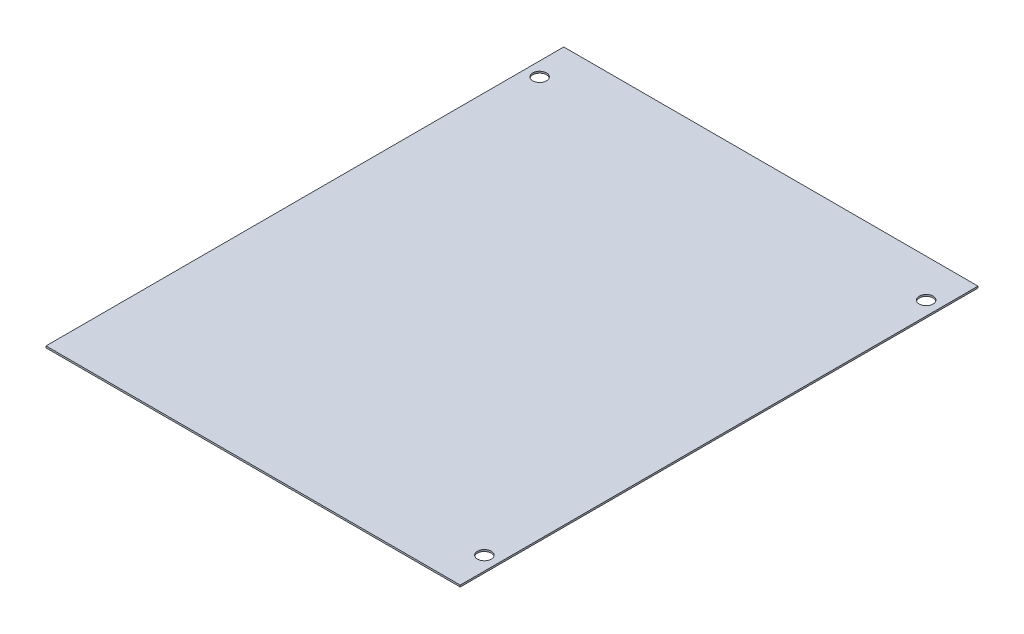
ISO-10303-21;
HEADER;
FILE_DESCRIPTION(('STEP AP214'),'2;1');
FILE_NAME('part.step','',(''),(''),'','','');
FILE_SCHEMA(('AUTOMOTIVE_DESIGN { 1 0 10303 214 1 1 1 1 }'));
ENDSEC;
DATA;
#1=APPLICATION_CONTEXT('core data for automotive mechanical design processes');
#2=APPLICATION_PROTOCOL_DEFINITION('international standard','automotive_design',2000,#1);
#3=PRODUCT_CONTEXT('',#1,'mechanical');
#4=PRODUCT('Part','Part','',(#3));
#5=PRODUCT_RELATED_PRODUCT_CATEGORY('part','',(#4));
#6=PRODUCT_DEFINITION_FORMATION('','',#4);
#7=PRODUCT_DEFINITION_CONTEXT('part definition',#1,'design');
#8=PRODUCT_DEFINITION('design','',#6,#7);
#9=PRODUCT_DEFINITION_SHAPE('','',#8);
#10=(LENGTH_UNIT() NAMED_UNIT(*) SI_UNIT(.MILLI.,.METRE.));
#11=(NAMED_UNIT(*) PLANE_ANGLE_UNIT() SI_UNIT($,.RADIAN.));
#12=(NAMED_UNIT(*) SI_UNIT($,.STERADIAN.) SOLID_ANGLE_UNIT());
#13=UNCERTAINTY_MEASURE_WITH_UNIT(LENGTH_MEASURE(1.E-05),#10,'distance_accuracy_value','');
#14=(GEOMETRIC_REPRESENTATION_CONTEXT(3) GLOBAL_UNCERTAINTY_ASSIGNED_CONTEXT((#13)) GLOBAL_UNIT_ASSIGNED_CONTEXT((#10,
#11,#12)) REPRESENTATION_CONTEXT('',''));
#15=CARTESIAN_POINT('',(0.,0.,0.));
#16=DIRECTION('',(0.,0.,1.));
#17=DIRECTION('',(1.,0.,0.));
#18=AXIS2_PLACEMENT_3D('',#15,#16,#17);
#19=CARTESIAN_POINT('',(-74.168738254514,6.35,-1849.30390133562));
#20=DIRECTION('',(1.,0.,0.));
#21=DIRECTION('',(0.,0.,-1.));
#22=AXIS2_PLACEMENT_3D('',#19,#20,#21);
#23=PLANE('',#22);
#24=DIRECTION('',(0.,0.,1.));
#25=VECTOR('',#24,1.);
#26=CARTESIAN_POINT('',(-74.168738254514,0.,-1849.30390133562));
#27=LINE('',#26,#25);
#28=CARTESIAN_POINT('',(-74.168738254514,0.,-1849.30390133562));
#29=VERTEX_POINT('',#28);
#30=CARTESIAN_POINT('',(-74.1687382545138,0.,55.6960986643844));
#31=VERTEX_POINT('',#30);
#32=EDGE_CURVE('E99',#29,#31,#27,.T.);
#33=ORIENTED_EDGE('',*,*,#32,.T.);
#34=DIRECTION('',(0.,-1.,0.));
#35=VECTOR('',#34,1.);
#36=CARTESIAN_POINT('',(-74.1687382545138,6.35,55.6960986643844));
#37=LINE('',#36,#35);
#38=CARTESIAN_POINT('',(-74.1687382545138,6.35,55.6960986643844));
#39=VERTEX_POINT('',#38);
#40=EDGE_CURVE('E11',#39,#31,#37,.T.);
#41=ORIENTED_EDGE('',*,*,#40,.F.);
#42=DIRECTION('',(0.,0.,1.));
#43=VECTOR('',#42,1.);
#44=CARTESIAN_POINT('',(-74.168738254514,6.35,-1849.30390133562));
#45=LINE('',#44,#43);
#46=CARTESIAN_POINT('',(-74.168738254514,6.35,-1849.30390133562));
#47=VERTEX_POINT('',#46);
#48=EDGE_CURVE('E86',#47,#39,#45,.T.);
#49=ORIENTED_EDGE('',*,*,#48,.F.);
#50=DIRECTION('',(0.,-1.,0.));
#51=VECTOR('',#50,1.);
#52=CARTESIAN_POINT('',(-74.168738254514,6.35,-1849.30390133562));
#53=LINE('',#52,#51);
#54=EDGE_CURVE('E95',#47,#29,#53,.T.);
#55=ORIENTED_EDGE('',*,*,#54,.T.);
#56=EDGE_LOOP('',(#33,#41,#49,#55));
#57=FACE_BOUND('',#56,.T.);
#58=ADVANCED_FACE('F33',(#57),#23,.F.);
#59=CARTESIAN_POINT('',(-74.1687382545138,6.35,55.6960986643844));
#60=DIRECTION('',(0.,0.,-1.));
#61=DIRECTION('',(-1.,0.,0.));
#62=AXIS2_PLACEMENT_3D('',#59,#60,#61);
#63=PLANE('',#62);
#64=DIRECTION('',(1.,0.,0.));
#65=VECTOR('',#64,1.);
#66=CARTESIAN_POINT('',(-74.1687382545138,0.,55.6960986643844));
#67=LINE('',#66,#65);
#68=CARTESIAN_POINT('',(1449.83126174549,0.,55.6960986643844));
#69=VERTEX_POINT('',#68);
#70=EDGE_CURVE('E90',#31,#69,#67,.T.);
#71=ORIENTED_EDGE('',*,*,#70,.T.);
#72=DIRECTION('',(0.,-1.,0.));
#73=VECTOR('',#72,1.);
#74=CARTESIAN_POINT('',(1449.83126174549,6.35,55.6960986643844));
#75=LINE('',#74,#73);
#76=CARTESIAN_POINT('',(1449.83126174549,6.35,55.6960986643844));
#77=VERTEX_POINT('',#76);
#78=EDGE_CURVE('E42',#77,#69,#75,.T.);
#79=ORIENTED_EDGE('',*,*,#78,.F.);
#80=DIRECTION('',(1.,0.,0.));
#81=VECTOR('',#80,1.);
#82=CARTESIAN_POINT('',(-74.1687382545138,6.35,55.6960986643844));
#83=LINE('',#82,#81);
#84=EDGE_CURVE('E81',#39,#77,#83,.T.);
#85=ORIENTED_EDGE('',*,*,#84,.F.);
#86=ORIENTED_EDGE('',*,*,#40,.T.);
#87=EDGE_LOOP('',(#71,#79,#85,#86));
#88=FACE_BOUND('',#87,.T.);
#89=ADVANCED_FACE('F89',(#88),#63,.F.);
#90=CARTESIAN_POINT('',(1449.83126174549,6.35,-1849.30390133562));
#91=DIRECTION('',(-1.,0.,0.));
#92=DIRECTION('',(0.,0.,1.));
#93=AXIS2_PLACEMENT_3D('',#90,#91,#92);
#94=PLANE('',#93);
#95=DIRECTION('',(0.,0.,-1.));
#96=VECTOR('',#95,1.);
#97=CARTESIAN_POINT('',(1449.83126174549,0.,-1849.30390133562));
#98=LINE('',#97,#96);
#99=CARTESIAN_POINT('',(1449.83126174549,0.,-1849.30390133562));
#100=VERTEX_POINT('',#99);
#101=EDGE_CURVE('E68',#69,#100,#98,.T.);
#102=ORIENTED_EDGE('',*,*,#101,.T.);
#103=DIRECTION('',(0.,-1.,0.));
#104=VECTOR('',#103,1.);
#105=CARTESIAN_POINT('',(1449.83126174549,6.35,-1849.30390133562));
#106=LINE('',#105,#104);
#107=CARTESIAN_POINT('',(1449.83126174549,6.35,-1849.30390133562));
#108=VERTEX_POINT('',#107);
#109=EDGE_CURVE('E91',#108,#100,#106,.T.);
#110=ORIENTED_EDGE('',*,*,#109,.F.);
#111=DIRECTION('',(0.,0.,-1.));
#112=VECTOR('',#111,1.);
#113=CARTESIAN_POINT('',(1449.83126174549,6.35,-1849.30390133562));
#114=LINE('',#113,#112);
#115=EDGE_CURVE('E84',#77,#108,#114,.T.);
#116=ORIENTED_EDGE('',*,*,#115,.F.);
#117=ORIENTED_EDGE('',*,*,#78,.T.);
#118=EDGE_LOOP('',(#102,#110,#116,#117));
#119=FACE_BOUND('',#118,.T.);
#120=ADVANCED_FACE('F93',(#119),#94,.F.);
#121=CARTESIAN_POINT('',(-74.168738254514,6.35,-1849.30390133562));
#122=DIRECTION('',(0.,0.,1.));
#123=DIRECTION('',(1.,0.,0.));
#124=AXIS2_PLACEMENT_3D('',#121,#122,#123);
#125=PLANE('',#124);
#126=DIRECTION('',(-1.,0.,0.));
#127=VECTOR('',#126,1.);
#128=CARTESIAN_POINT('',(-74.168738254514,0.,-1849.30390133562));
#129=LINE('',#128,#127);
#130=EDGE_CURVE('E74',#100,#29,#129,.T.);
#131=ORIENTED_EDGE('',*,*,#130,.T.);
#132=ORIENTED_EDGE('',*,*,#54,.F.);
#133=DIRECTION('',(-1.,0.,0.));
#134=VECTOR('',#133,1.);
#135=CARTESIAN_POINT('',(-74.168738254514,6.35,-1849.30390133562));
#136=LINE('',#135,#134);
#137=EDGE_CURVE('E51',#108,#47,#136,.T.);
#138=ORIENTED_EDGE('',*,*,#137,.F.);
#139=ORIENTED_EDGE('',*,*,#109,.T.);
#140=EDGE_LOOP('',(#131,#132,#138,#139));
#141=FACE_BOUND('',#140,.T.);
#142=ADVANCED_FACE('F133',(#141),#125,.F.);
#143=CARTESIAN_POINT('',(-74.1687382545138,6.35,55.6960986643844));
#144=DIRECTION('',(0.,1.,0.));
#145=DIRECTION('',(0.,0.,1.));
#146=AXIS2_PLACEMENT_3D('',#143,#144,#145);
#147=PLANE('',#146);
#148=CARTESIAN_POINT('',(1399.03126174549,6.35,-84.0039013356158));
#149=DIRECTION('',(0.,1.,0.));
#150=DIRECTION('',(0.,0.,1.));
#151=AXIS2_PLACEMENT_3D('',#148,#149,#150);
#152=CIRCLE('',#151,25.4);
#153=CARTESIAN_POINT('',(1399.03126174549,6.35,-58.6039013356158));
#154=VERTEX_POINT('',#153);
#155=EDGE_CURVE('E122',#154,#154,#152,.T.);
#156=ORIENTED_EDGE('',*,*,#155,.F.);
#157=EDGE_LOOP('',(#156));
#158=FACE_BOUND('',#157,.T.);
#159=CARTESIAN_POINT('',(1399.03126174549,6.35,-1709.60390133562));
#160=DIRECTION('',(0.,1.,0.));
#161=DIRECTION('',(0.,0.,1.));
#162=AXIS2_PLACEMENT_3D('',#159,#160,#161);
#163=CIRCLE('',#162,25.4);
#164=CARTESIAN_POINT('',(1399.03126174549,6.35,-1684.20390133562));
#165=VERTEX_POINT('',#164);
#166=EDGE_CURVE('E112',#165,#165,#163,.T.);
#167=ORIENTED_EDGE('',*,*,#166,.F.);
#168=EDGE_LOOP('',(#167));
#169=FACE_BOUND('',#168,.T.);
#170=CARTESIAN_POINT('',(-23.368738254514,6.35,-1709.60390133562));
#171=DIRECTION('',(0.,1.,0.));
#172=DIRECTION('',(0.,0.,1.));
#173=AXIS2_PLACEMENT_3D('',#170,#171,#172);
#174=CIRCLE('',#173,25.4);
#175=CARTESIAN_POINT('',(-23.368738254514,6.35,-1684.20390133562));
#176=VERTEX_POINT('',#175);
#177=EDGE_CURVE('E109',#176,#176,#174,.T.);
#178=ORIENTED_EDGE('',*,*,#177,.F.);
#179=EDGE_LOOP('',(#178));
#180=FACE_BOUND('',#179,.T.);
#181=ORIENTED_EDGE('',*,*,#48,.T.);
#182=ORIENTED_EDGE('',*,*,#84,.T.);
#183=ORIENTED_EDGE('',*,*,#115,.T.);
#184=ORIENTED_EDGE('',*,*,#137,.T.);
#185=EDGE_LOOP('',(#181,#182,#183,#184));
#186=FACE_BOUND('',#185,.T.);
#187=ADVANCED_FACE('F82',(#158,#169,#180,#186),#147,.T.);
#188=CARTESIAN_POINT('',(-74.1687382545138,0.,55.6960986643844));
#189=DIRECTION('',(0.,1.,0.));
#190=DIRECTION('',(0.,0.,1.));
#191=AXIS2_PLACEMENT_3D('',#188,#189,#190);
#192=PLANE('',#191);
#193=CARTESIAN_POINT('',(1399.03126174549,0.,-84.0039013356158));
#194=DIRECTION('',(0.,1.,0.));
#195=DIRECTION('',(0.,0.,1.));
#196=AXIS2_PLACEMENT_3D('',#193,#194,#195);
#197=CIRCLE('',#196,25.4);
#198=CARTESIAN_POINT('',(1399.03126174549,0.,-58.6039013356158));
#199=VERTEX_POINT('',#198);
#200=EDGE_CURVE('E36',#199,#199,#197,.T.);
#201=ORIENTED_EDGE('',*,*,#200,.T.);
#202=EDGE_LOOP('',(#201));
#203=FACE_BOUND('',#202,.T.);
#204=CARTESIAN_POINT('',(1399.03126174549,0.,-1709.60390133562));
#205=DIRECTION('',(0.,1.,0.));
#206=DIRECTION('',(0.,0.,1.));
#207=AXIS2_PLACEMENT_3D('',#204,#205,#206);
#208=CIRCLE('',#207,25.4);
#209=CARTESIAN_POINT('',(1399.03126174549,0.,-1684.20390133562));
#210=VERTEX_POINT('',#209);
#211=EDGE_CURVE('E110',#210,#210,#208,.T.);
#212=ORIENTED_EDGE('',*,*,#211,.T.);
#213=EDGE_LOOP('',(#212));
#214=FACE_BOUND('',#213,.T.);
#215=CARTESIAN_POINT('',(-23.368738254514,0.,-1709.60390133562));
#216=DIRECTION('',(0.,1.,0.));
#217=DIRECTION('',(0.,0.,1.));
#218=AXIS2_PLACEMENT_3D('',#215,#216,#217);
#219=CIRCLE('',#218,25.4);
#220=CARTESIAN_POINT('',(-23.368738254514,0.,-1684.20390133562));
#221=VERTEX_POINT('',#220);
#222=EDGE_CURVE('E102',#221,#221,#219,.T.);
#223=ORIENTED_EDGE('',*,*,#222,.T.);
#224=EDGE_LOOP('',(#223));
#225=FACE_BOUND('',#224,.T.);
#226=ORIENTED_EDGE('',*,*,#32,.F.);
#227=ORIENTED_EDGE('',*,*,#130,.F.);
#228=ORIENTED_EDGE('',*,*,#101,.F.);
#229=ORIENTED_EDGE('',*,*,#70,.F.);
#230=EDGE_LOOP('',(#226,#227,#228,#229));
#231=FACE_BOUND('',#230,.T.);
#232=ADVANCED_FACE('F132',(#203,#214,#225,#231),#192,.F.);
#233=CARTESIAN_POINT('',(-23.368738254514,-19.05,-1709.60390133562));
#234=DIRECTION('',(0.,1.,0.));
#235=DIRECTION('',(0.,0.,1.));
#236=AXIS2_PLACEMENT_3D('',#233,#234,#235);
#237=CYLINDRICAL_SURFACE('',#236,25.4);
#238=ORIENTED_EDGE('',*,*,#177,.T.);
#239=EDGE_LOOP('',(#238));
#240=FACE_BOUND('',#239,.T.);
#241=ORIENTED_EDGE('',*,*,#222,.F.);
#242=EDGE_LOOP('',(#241));
#243=FACE_BOUND('',#242,.T.);
#244=ADVANCED_FACE('F138',(#240,#243),#237,.F.);
#245=CARTESIAN_POINT('',(1399.03126174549,-19.05,-1709.60390133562));
#246=DIRECTION('',(0.,1.,0.));
#247=DIRECTION('',(0.,0.,1.));
#248=AXIS2_PLACEMENT_3D('',#245,#246,#247);
#249=CYLINDRICAL_SURFACE('',#248,25.4);
#250=ORIENTED_EDGE('',*,*,#166,.T.);
#251=EDGE_LOOP('',(#250));
#252=FACE_BOUND('',#251,.T.);
#253=ORIENTED_EDGE('',*,*,#211,.F.);
#254=EDGE_LOOP('',(#253));
#255=FACE_BOUND('',#254,.T.);
#256=ADVANCED_FACE('F141',(#252,#255),#249,.F.);
#257=CARTESIAN_POINT('',(1399.03126174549,-19.05,-84.0039013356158));
#258=DIRECTION('',(0.,1.,0.));
#259=DIRECTION('',(0.,0.,1.));
#260=AXIS2_PLACEMENT_3D('',#257,#258,#259);
#261=CYLINDRICAL_SURFACE('',#260,25.4);
#262=ORIENTED_EDGE('',*,*,#155,.T.);
#263=EDGE_LOOP('',(#262));
#264=FACE_BOUND('',#263,.T.);
#265=ORIENTED_EDGE('',*,*,#200,.F.);
#266=EDGE_LOOP('',(#265));
#267=FACE_BOUND('',#266,.T.);
#268=ADVANCED_FACE('F127',(#264,#267),#261,.F.);
#269=CLOSED_SHELL('',(#58,#89,#120,#142,#187,#232,#244,#256,#268));
#270=MANIFOLD_SOLID_BREP('B2',#269);
#271=ADVANCED_BREP_SHAPE_REPRESENTATION('',(#18,#270),#14);
#272=SHAPE_DEFINITION_REPRESENTATION(#9,#271);
ENDSEC;
END-ISO-10303-21;
